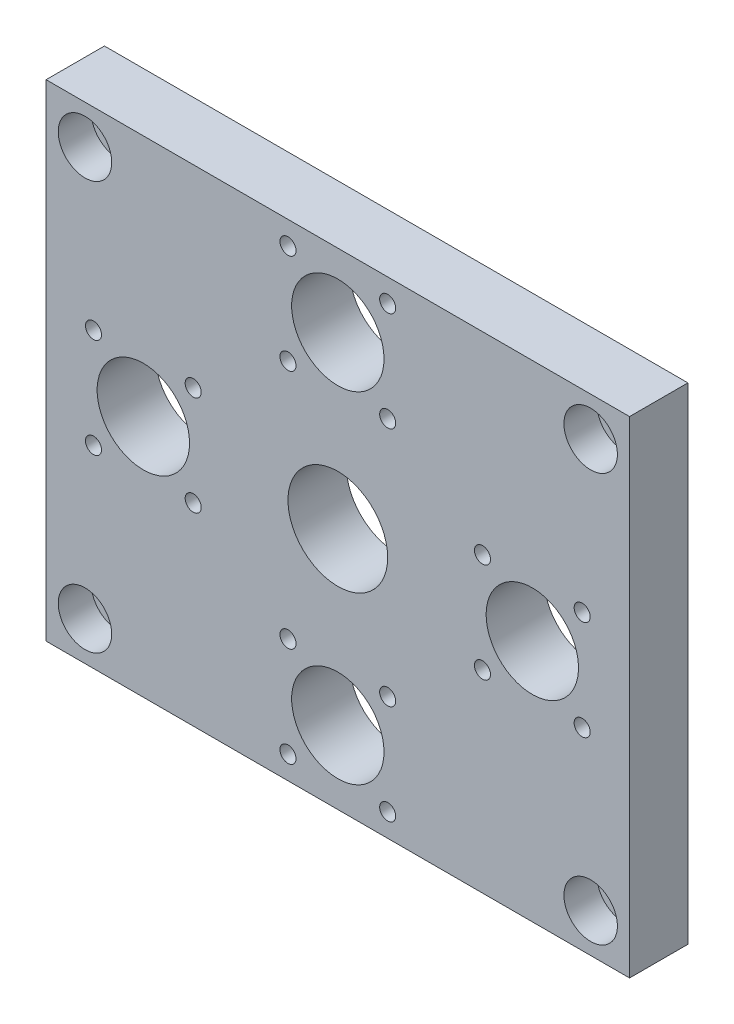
ISO-10303-21;
HEADER;
FILE_DESCRIPTION(('STEP AP214'),'2;1');
FILE_NAME('part.step','',(''),(''),'','','');
FILE_SCHEMA(('AUTOMOTIVE_DESIGN { 1 0 10303 214 1 1 1 1 }'));
ENDSEC;
DATA;
#1=APPLICATION_CONTEXT('core data for automotive mechanical design processes');
#2=APPLICATION_PROTOCOL_DEFINITION('international standard','automotive_design',2000,#1);
#3=PRODUCT_CONTEXT('',#1,'mechanical');
#4=PRODUCT('Part','Part','',(#3));
#5=PRODUCT_RELATED_PRODUCT_CATEGORY('part','',(#4));
#6=PRODUCT_DEFINITION_FORMATION('','',#4);
#7=PRODUCT_DEFINITION_CONTEXT('part definition',#1,'design');
#8=PRODUCT_DEFINITION('design','',#6,#7);
#9=PRODUCT_DEFINITION_SHAPE('','',#8);
#10=(LENGTH_UNIT() NAMED_UNIT(*) SI_UNIT(.MILLI.,.METRE.));
#11=(NAMED_UNIT(*) PLANE_ANGLE_UNIT() SI_UNIT($,.RADIAN.));
#12=(NAMED_UNIT(*) SI_UNIT($,.STERADIAN.) SOLID_ANGLE_UNIT());
#13=UNCERTAINTY_MEASURE_WITH_UNIT(LENGTH_MEASURE(1.E-05),#10,'distance_accuracy_value','');
#14=(GEOMETRIC_REPRESENTATION_CONTEXT(3) GLOBAL_UNCERTAINTY_ASSIGNED_CONTEXT((#13)) GLOBAL_UNIT_ASSIGNED_CONTEXT((#10,
#11,#12)) REPRESENTATION_CONTEXT('',''));
#15=CARTESIAN_POINT('',(0.,0.,0.));
#16=DIRECTION('',(0.,0.,1.));
#17=DIRECTION('',(1.,0.,0.));
#18=AXIS2_PLACEMENT_3D('',#15,#16,#17);
#19=CARTESIAN_POINT('',(-343.662294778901,150.72632828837,12.));
#20=DIRECTION('',(0.,0.,1.));
#21=DIRECTION('',(1.,0.,0.));
#22=AXIS2_PLACEMENT_3D('',#19,#20,#21);
#23=CYLINDRICAL_SURFACE('',#22,3.3);
#24=CARTESIAN_POINT('',(-343.662294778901,150.72632828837,5.2));
#25=DIRECTION('',(0.,0.,1.));
#26=DIRECTION('',(1.,0.,0.));
#27=AXIS2_PLACEMENT_3D('',#24,#25,#26);
#28=CIRCLE('',#27,3.3);
#29=CARTESIAN_POINT('',(-340.362294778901,150.72632828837,5.2));
#30=VERTEX_POINT('',#29);
#31=EDGE_CURVE('E131',#30,#30,#28,.T.);
#32=ORIENTED_EDGE('',*,*,#31,.T.);
#33=EDGE_LOOP('',(#32));
#34=FACE_BOUND('',#33,.T.);
#35=CARTESIAN_POINT('',(-343.662294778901,150.72632828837,2.));
#36=DIRECTION('',(0.,0.,-1.));
#37=DIRECTION('',(-1.,0.,0.));
#38=AXIS2_PLACEMENT_3D('',#35,#36,#37);
#39=CIRCLE('',#38,3.3);
#40=CARTESIAN_POINT('',(-346.962294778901,150.72632828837,2.));
#41=VERTEX_POINT('',#40);
#42=EDGE_CURVE('E97',#41,#41,#39,.F.);
#43=ORIENTED_EDGE('',*,*,#42,.F.);
#44=EDGE_LOOP('',(#43));
#45=FACE_BOUND('',#44,.T.);
#46=ADVANCED_FACE('F16',(#34,#45),#23,.F.);
#47=CARTESIAN_POINT('',(-343.662294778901,66.7263282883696,12.));
#48=DIRECTION('',(0.,0.,1.));
#49=DIRECTION('',(1.,0.,0.));
#50=AXIS2_PLACEMENT_3D('',#47,#48,#49);
#51=CYLINDRICAL_SURFACE('',#50,3.3);
#52=CARTESIAN_POINT('',(-343.662294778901,66.7263282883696,5.2));
#53=DIRECTION('',(0.,0.,1.));
#54=DIRECTION('',(1.,0.,0.));
#55=AXIS2_PLACEMENT_3D('',#52,#53,#54);
#56=CIRCLE('',#55,3.3);
#57=CARTESIAN_POINT('',(-340.362294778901,66.7263282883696,5.2));
#58=VERTEX_POINT('',#57);
#59=EDGE_CURVE('E140',#58,#58,#56,.T.);
#60=ORIENTED_EDGE('',*,*,#59,.T.);
#61=EDGE_LOOP('',(#60));
#62=FACE_BOUND('',#61,.T.);
#63=CARTESIAN_POINT('',(-343.662294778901,66.7263282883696,2.));
#64=DIRECTION('',(0.,0.,-1.));
#65=DIRECTION('',(-1.,0.,0.));
#66=AXIS2_PLACEMENT_3D('',#63,#64,#65);
#67=CIRCLE('',#66,3.3);
#68=CARTESIAN_POINT('',(-346.962294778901,66.7263282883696,2.));
#69=VERTEX_POINT('',#68);
#70=EDGE_CURVE('E92',#69,#69,#67,.F.);
#71=ORIENTED_EDGE('',*,*,#70,.F.);
#72=EDGE_LOOP('',(#71));
#73=FACE_BOUND('',#72,.T.);
#74=ADVANCED_FACE('F193',(#62,#73),#51,.F.);
#75=CARTESIAN_POINT('',(-335.662294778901,158.72632828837,12.));
#76=DIRECTION('',(-1.,0.,0.));
#77=DIRECTION('',(0.,0.,1.));
#78=AXIS2_PLACEMENT_3D('',#75,#76,#77);
#79=PLANE('',#78);
#80=DIRECTION('',(0.,1.,0.));
#81=VECTOR('',#80,1.);
#82=CARTESIAN_POINT('',(-335.662294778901,158.72632828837,0.));
#83=LINE('',#82,#81);
#84=CARTESIAN_POINT('',(-335.662294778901,58.7263282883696,0.));
#85=VERTEX_POINT('',#84);
#86=CARTESIAN_POINT('',(-335.662294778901,158.72632828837,0.));
#87=VERTEX_POINT('',#86);
#88=EDGE_CURVE('E83',#85,#87,#83,.T.);
#89=ORIENTED_EDGE('',*,*,#88,.T.);
#90=DIRECTION('',(0.,0.,-1.));
#91=VECTOR('',#90,1.);
#92=CARTESIAN_POINT('',(-335.662294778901,158.72632828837,12.));
#93=LINE('',#92,#91);
#94=CARTESIAN_POINT('',(-335.662294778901,158.72632828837,12.));
#95=VERTEX_POINT('',#94);
#96=EDGE_CURVE('E11',#95,#87,#93,.T.);
#97=ORIENTED_EDGE('',*,*,#96,.F.);
#98=DIRECTION('',(0.,1.,0.));
#99=VECTOR('',#98,1.);
#100=CARTESIAN_POINT('',(-335.662294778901,158.72632828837,12.));
#101=LINE('',#100,#99);
#102=CARTESIAN_POINT('',(-335.662294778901,58.7263282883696,12.));
#103=VERTEX_POINT('',#102);
#104=EDGE_CURVE('E70',#103,#95,#101,.T.);
#105=ORIENTED_EDGE('',*,*,#104,.F.);
#106=DIRECTION('',(0.,0.,-1.));
#107=VECTOR('',#106,1.);
#108=CARTESIAN_POINT('',(-335.662294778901,58.7263282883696,12.));
#109=LINE('',#108,#107);
#110=EDGE_CURVE('E79',#103,#85,#109,.T.);
#111=ORIENTED_EDGE('',*,*,#110,.T.);
#112=EDGE_LOOP('',(#89,#97,#105,#111));
#113=FACE_BOUND('',#112,.T.);
#114=ADVANCED_FACE('F18',(#113),#79,.F.);
#115=CARTESIAN_POINT('',(-455.662294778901,158.72632828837,12.));
#116=DIRECTION('',(0.,-1.,0.));
#117=DIRECTION('',(0.,0.,-1.));
#118=AXIS2_PLACEMENT_3D('',#115,#116,#117);
#119=PLANE('',#118);
#120=DIRECTION('',(-1.,0.,0.));
#121=VECTOR('',#120,1.);
#122=CARTESIAN_POINT('',(-455.662294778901,158.72632828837,0.));
#123=LINE('',#122,#121);
#124=CARTESIAN_POINT('',(-455.662294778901,158.72632828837,0.));
#125=VERTEX_POINT('',#124);
#126=EDGE_CURVE('E74',#87,#125,#123,.T.);
#127=ORIENTED_EDGE('',*,*,#126,.T.);
#128=DIRECTION('',(0.,0.,-1.));
#129=VECTOR('',#128,1.);
#130=CARTESIAN_POINT('',(-455.662294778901,158.72632828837,12.));
#131=LINE('',#130,#129);
#132=CARTESIAN_POINT('',(-455.662294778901,158.72632828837,12.));
#133=VERTEX_POINT('',#132);
#134=EDGE_CURVE('E26',#133,#125,#131,.T.);
#135=ORIENTED_EDGE('',*,*,#134,.F.);
#136=DIRECTION('',(-1.,0.,0.));
#137=VECTOR('',#136,1.);
#138=CARTESIAN_POINT('',(-455.662294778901,158.72632828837,12.));
#139=LINE('',#138,#137);
#140=EDGE_CURVE('E65',#95,#133,#139,.T.);
#141=ORIENTED_EDGE('',*,*,#140,.F.);
#142=ORIENTED_EDGE('',*,*,#96,.T.);
#143=EDGE_LOOP('',(#127,#135,#141,#142));
#144=FACE_BOUND('',#143,.T.);
#145=ADVANCED_FACE('F73',(#144),#119,.F.);
#146=CARTESIAN_POINT('',(-455.662294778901,158.72632828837,12.));
#147=DIRECTION('',(1.,0.,0.));
#148=DIRECTION('',(0.,0.,-1.));
#149=AXIS2_PLACEMENT_3D('',#146,#147,#148);
#150=PLANE('',#149);
#151=DIRECTION('',(0.,-1.,0.));
#152=VECTOR('',#151,1.);
#153=CARTESIAN_POINT('',(-455.662294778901,158.72632828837,0.));
#154=LINE('',#153,#152);
#155=CARTESIAN_POINT('',(-455.662294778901,58.7263282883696,0.));
#156=VERTEX_POINT('',#155);
#157=EDGE_CURVE('E52',#125,#156,#154,.T.);
#158=ORIENTED_EDGE('',*,*,#157,.T.);
#159=DIRECTION('',(0.,0.,-1.));
#160=VECTOR('',#159,1.);
#161=CARTESIAN_POINT('',(-455.662294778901,58.7263282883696,12.));
#162=LINE('',#161,#160);
#163=CARTESIAN_POINT('',(-455.662294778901,58.7263282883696,12.));
#164=VERTEX_POINT('',#163);
#165=EDGE_CURVE('E75',#164,#156,#162,.T.);
#166=ORIENTED_EDGE('',*,*,#165,.F.);
#167=DIRECTION('',(0.,-1.,0.));
#168=VECTOR('',#167,1.);
#169=CARTESIAN_POINT('',(-455.662294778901,158.72632828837,12.));
#170=LINE('',#169,#168);
#171=EDGE_CURVE('E68',#133,#164,#170,.T.);
#172=ORIENTED_EDGE('',*,*,#171,.F.);
#173=ORIENTED_EDGE('',*,*,#134,.T.);
#174=EDGE_LOOP('',(#158,#166,#172,#173));
#175=FACE_BOUND('',#174,.T.);
#176=ADVANCED_FACE('F77',(#175),#150,.F.);
#177=CARTESIAN_POINT('',(-455.662294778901,58.7263282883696,12.));
#178=DIRECTION('',(0.,1.,0.));
#179=DIRECTION('',(0.,0.,1.));
#180=AXIS2_PLACEMENT_3D('',#177,#178,#179);
#181=PLANE('',#180);
#182=DIRECTION('',(1.,0.,0.));
#183=VECTOR('',#182,1.);
#184=CARTESIAN_POINT('',(-455.662294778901,58.7263282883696,0.));
#185=LINE('',#184,#183);
#186=EDGE_CURVE('E58',#156,#85,#185,.T.);
#187=ORIENTED_EDGE('',*,*,#186,.T.);
#188=ORIENTED_EDGE('',*,*,#110,.F.);
#189=DIRECTION('',(1.,0.,0.));
#190=VECTOR('',#189,1.);
#191=CARTESIAN_POINT('',(-455.662294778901,58.7263282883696,12.));
#192=LINE('',#191,#190);
#193=EDGE_CURVE('E35',#164,#103,#192,.T.);
#194=ORIENTED_EDGE('',*,*,#193,.F.);
#195=ORIENTED_EDGE('',*,*,#165,.T.);
#196=EDGE_LOOP('',(#187,#188,#194,#195));
#197=FACE_BOUND('',#196,.T.);
#198=ADVANCED_FACE('F178',(#197),#181,.F.);
#199=CARTESIAN_POINT('',(0.,0.,12.));
#200=DIRECTION('',(0.,0.,1.));
#201=DIRECTION('',(1.,0.,0.));
#202=AXIS2_PLACEMENT_3D('',#199,#200,#201);
#203=PLANE('',#202);
#204=CARTESIAN_POINT('',(-345.409246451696,118.979376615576,12.));
#205=DIRECTION('',(0.,0.,1.));
#206=DIRECTION('',(1.,0.,0.));
#207=AXIS2_PLACEMENT_3D('',#204,#205,#206);
#208=CIRCLE('',#207,1.65);
#209=CARTESIAN_POINT('',(-343.759246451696,118.979376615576,12.));
#210=VERTEX_POINT('',#209);
#211=EDGE_CURVE('E653',#210,#210,#208,.T.);
#212=ORIENTED_EDGE('',*,*,#211,.F.);
#213=EDGE_LOOP('',(#212));
#214=FACE_BOUND('',#213,.T.);
#215=CARTESIAN_POINT('',(-345.409246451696,98.4732799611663,12.));
#216=DIRECTION('',(0.,0.,1.));
#217=DIRECTION('',(1.,0.,0.));
#218=AXIS2_PLACEMENT_3D('',#215,#216,#217);
#219=CIRCLE('',#218,1.65);
#220=CARTESIAN_POINT('',(-343.759246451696,98.4732799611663,12.));
#221=VERTEX_POINT('',#220);
#222=EDGE_CURVE('E655',#221,#221,#219,.T.);
#223=ORIENTED_EDGE('',*,*,#222,.F.);
#224=EDGE_LOOP('',(#223));
#225=FACE_BOUND('',#224,.T.);
#226=CARTESIAN_POINT('',(-365.915343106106,98.4732799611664,12.));
#227=DIRECTION('',(0.,0.,1.));
#228=DIRECTION('',(1.,0.,0.));
#229=AXIS2_PLACEMENT_3D('',#226,#227,#228);
#230=CIRCLE('',#229,1.65);
#231=CARTESIAN_POINT('',(-364.265343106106,98.4732799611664,12.));
#232=VERTEX_POINT('',#231);
#233=EDGE_CURVE('E663',#232,#232,#230,.T.);
#234=ORIENTED_EDGE('',*,*,#233,.F.);
#235=EDGE_LOOP('',(#234));
#236=FACE_BOUND('',#235,.T.);
#237=CARTESIAN_POINT('',(-365.915343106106,118.979376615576,12.));
#238=DIRECTION('',(0.,0.,1.));
#239=DIRECTION('',(1.,0.,0.));
#240=AXIS2_PLACEMENT_3D('',#237,#238,#239);
#241=CIRCLE('',#240,1.65);
#242=CARTESIAN_POINT('',(-364.265343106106,118.979376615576,12.));
#243=VERTEX_POINT('',#242);
#244=EDGE_CURVE('E669',#243,#243,#241,.T.);
#245=ORIENTED_EDGE('',*,*,#244,.F.);
#246=EDGE_LOOP('',(#245));
#247=FACE_BOUND('',#246,.T.);
#248=CARTESIAN_POINT('',(-405.915343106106,83.9793766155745,12.));
#249=DIRECTION('',(0.,0.,1.));
#250=DIRECTION('',(1.,0.,0.));
#251=AXIS2_PLACEMENT_3D('',#248,#249,#250);
#252=CIRCLE('',#251,1.65);
#253=CARTESIAN_POINT('',(-404.265343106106,83.9793766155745,12.));
#254=VERTEX_POINT('',#253);
#255=EDGE_CURVE('E675',#254,#254,#252,.T.);
#256=ORIENTED_EDGE('',*,*,#255,.F.);
#257=EDGE_LOOP('',(#256));
#258=FACE_BOUND('',#257,.T.);
#259=CARTESIAN_POINT('',(-385.409246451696,83.9793766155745,12.));
#260=DIRECTION('',(0.,0.,1.));
#261=DIRECTION('',(1.,0.,0.));
#262=AXIS2_PLACEMENT_3D('',#259,#260,#261);
#263=CIRCLE('',#262,1.65);
#264=CARTESIAN_POINT('',(-383.759246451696,83.9793766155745,12.));
#265=VERTEX_POINT('',#264);
#266=EDGE_CURVE('E681',#265,#265,#263,.T.);
#267=ORIENTED_EDGE('',*,*,#266,.F.);
#268=EDGE_LOOP('',(#267));
#269=FACE_BOUND('',#268,.T.);
#270=CARTESIAN_POINT('',(-385.409246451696,63.4732799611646,12.));
#271=DIRECTION('',(0.,0.,1.));
#272=DIRECTION('',(1.,0.,0.));
#273=AXIS2_PLACEMENT_3D('',#270,#271,#272);
#274=CIRCLE('',#273,1.65);
#275=CARTESIAN_POINT('',(-383.759246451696,63.4732799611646,12.));
#276=VERTEX_POINT('',#275);
#277=EDGE_CURVE('E687',#276,#276,#274,.T.);
#278=ORIENTED_EDGE('',*,*,#277,.F.);
#279=EDGE_LOOP('',(#278));
#280=FACE_BOUND('',#279,.T.);
#281=CARTESIAN_POINT('',(-405.915343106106,63.4732799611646,12.));
#282=DIRECTION('',(0.,0.,1.));
#283=DIRECTION('',(1.,0.,0.));
#284=AXIS2_PLACEMENT_3D('',#281,#282,#283);
#285=CIRCLE('',#284,1.65);
#286=CARTESIAN_POINT('',(-404.265343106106,63.4732799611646,12.));
#287=VERTEX_POINT('',#286);
#288=EDGE_CURVE('E693',#287,#287,#285,.T.);
#289=ORIENTED_EDGE('',*,*,#288,.F.);
#290=EDGE_LOOP('',(#289));
#291=FACE_BOUND('',#290,.T.);
#292=CARTESIAN_POINT('',(-405.915343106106,153.979376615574,12.));
#293=DIRECTION('',(0.,0.,1.));
#294=DIRECTION('',(1.,0.,0.));
#295=AXIS2_PLACEMENT_3D('',#292,#293,#294);
#296=CIRCLE('',#295,1.65);
#297=CARTESIAN_POINT('',(-404.265343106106,153.979376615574,12.));
#298=VERTEX_POINT('',#297);
#299=EDGE_CURVE('E699',#298,#298,#296,.T.);
#300=ORIENTED_EDGE('',*,*,#299,.F.);
#301=EDGE_LOOP('',(#300));
#302=FACE_BOUND('',#301,.T.);
#303=CARTESIAN_POINT('',(-385.409246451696,153.979376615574,12.));
#304=DIRECTION('',(0.,0.,1.));
#305=DIRECTION('',(1.,0.,0.));
#306=AXIS2_PLACEMENT_3D('',#303,#304,#305);
#307=CIRCLE('',#306,1.65);
#308=CARTESIAN_POINT('',(-383.759246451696,153.979376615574,12.));
#309=VERTEX_POINT('',#308);
#310=EDGE_CURVE('E705',#309,#309,#307,.T.);
#311=ORIENTED_EDGE('',*,*,#310,.F.);
#312=EDGE_LOOP('',(#311));
#313=FACE_BOUND('',#312,.T.);
#314=CARTESIAN_POINT('',(-385.409246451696,133.473279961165,12.));
#315=DIRECTION('',(0.,0.,1.));
#316=DIRECTION('',(1.,0.,0.));
#317=AXIS2_PLACEMENT_3D('',#314,#315,#316);
#318=CIRCLE('',#317,1.65);
#319=CARTESIAN_POINT('',(-383.759246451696,133.473279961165,12.));
#320=VERTEX_POINT('',#319);
#321=EDGE_CURVE('E711',#320,#320,#318,.T.);
#322=ORIENTED_EDGE('',*,*,#321,.F.);
#323=EDGE_LOOP('',(#322));
#324=FACE_BOUND('',#323,.T.);
#325=CARTESIAN_POINT('',(-405.915343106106,133.473279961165,12.));
#326=DIRECTION('',(0.,0.,1.));
#327=DIRECTION('',(1.,0.,0.));
#328=AXIS2_PLACEMENT_3D('',#325,#326,#327);
#329=CIRCLE('',#328,1.65);
#330=CARTESIAN_POINT('',(-404.265343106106,133.473279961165,12.));
#331=VERTEX_POINT('',#330);
#332=EDGE_CURVE('E717',#331,#331,#329,.T.);
#333=ORIENTED_EDGE('',*,*,#332,.F.);
#334=EDGE_LOOP('',(#333));
#335=FACE_BOUND('',#334,.T.);
#336=CARTESIAN_POINT('',(-425.409246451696,98.4732799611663,12.));
#337=DIRECTION('',(0.,0.,1.));
#338=DIRECTION('',(1.,0.,0.));
#339=AXIS2_PLACEMENT_3D('',#336,#337,#338);
#340=CIRCLE('',#339,1.65);
#341=CARTESIAN_POINT('',(-423.759246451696,98.4732799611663,12.));
#342=VERTEX_POINT('',#341);
#343=EDGE_CURVE('E723',#342,#342,#340,.T.);
#344=ORIENTED_EDGE('',*,*,#343,.F.);
#345=EDGE_LOOP('',(#344));
#346=FACE_BOUND('',#345,.T.);
#347=CARTESIAN_POINT('',(-425.409246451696,118.979376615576,12.));
#348=DIRECTION('',(0.,0.,1.));
#349=DIRECTION('',(1.,0.,0.));
#350=AXIS2_PLACEMENT_3D('',#347,#348,#349);
#351=CIRCLE('',#350,1.65);
#352=CARTESIAN_POINT('',(-423.759246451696,118.979376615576,12.));
#353=VERTEX_POINT('',#352);
#354=EDGE_CURVE('E729',#353,#353,#351,.T.);
#355=ORIENTED_EDGE('',*,*,#354,.F.);
#356=EDGE_LOOP('',(#355));
#357=FACE_BOUND('',#356,.T.);
#358=CARTESIAN_POINT('',(-445.915343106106,118.979376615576,12.));
#359=DIRECTION('',(0.,0.,1.));
#360=DIRECTION('',(1.,0.,0.));
#361=AXIS2_PLACEMENT_3D('',#358,#359,#360);
#362=CIRCLE('',#361,1.65);
#363=CARTESIAN_POINT('',(-444.265343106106,118.979376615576,12.));
#364=VERTEX_POINT('',#363);
#365=EDGE_CURVE('E735',#364,#364,#362,.T.);
#366=ORIENTED_EDGE('',*,*,#365,.F.);
#367=EDGE_LOOP('',(#366));
#368=FACE_BOUND('',#367,.T.);
#369=CARTESIAN_POINT('',(-445.915343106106,98.4732799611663,12.));
#370=DIRECTION('',(0.,0.,1.));
#371=DIRECTION('',(1.,0.,0.));
#372=AXIS2_PLACEMENT_3D('',#369,#370,#371);
#373=CIRCLE('',#372,1.65);
#374=CARTESIAN_POINT('',(-444.265343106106,98.4732799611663,12.));
#375=VERTEX_POINT('',#374);
#376=EDGE_CURVE('E741',#375,#375,#373,.T.);
#377=ORIENTED_EDGE('',*,*,#376,.F.);
#378=EDGE_LOOP('',(#377));
#379=FACE_BOUND('',#378,.T.);
#380=CARTESIAN_POINT('',(-395.662294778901,73.7263282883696,12.));
#381=DIRECTION('',(0.,0.,1.));
#382=DIRECTION('',(1.,0.,0.));
#383=AXIS2_PLACEMENT_3D('',#380,#381,#382);
#384=CIRCLE('',#383,9.5);
#385=CARTESIAN_POINT('',(-386.162294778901,73.7263282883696,12.));
#386=VERTEX_POINT('',#385);
#387=EDGE_CURVE('E747',#386,#386,#384,.T.);
#388=ORIENTED_EDGE('',*,*,#387,.F.);
#389=EDGE_LOOP('',(#388));
#390=FACE_BOUND('',#389,.T.);
#391=CARTESIAN_POINT('',(-395.662294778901,143.72632828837,12.));
#392=DIRECTION('',(0.,0.,1.));
#393=DIRECTION('',(1.,0.,0.));
#394=AXIS2_PLACEMENT_3D('',#391,#392,#393);
#395=CIRCLE('',#394,9.5);
#396=CARTESIAN_POINT('',(-386.162294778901,143.72632828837,12.));
#397=VERTEX_POINT('',#396);
#398=EDGE_CURVE('E751',#397,#397,#395,.T.);
#399=ORIENTED_EDGE('',*,*,#398,.F.);
#400=EDGE_LOOP('',(#399));
#401=FACE_BOUND('',#400,.T.);
#402=CARTESIAN_POINT('',(-355.662294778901,108.726328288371,12.));
#403=DIRECTION('',(0.,0.,1.));
#404=DIRECTION('',(-1.,0.,0.));
#405=AXIS2_PLACEMENT_3D('',#402,#403,#404);
#406=CIRCLE('',#405,9.5);
#407=CARTESIAN_POINT('',(-365.162294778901,108.726328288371,12.));
#408=VERTEX_POINT('',#407);
#409=EDGE_CURVE('E757',#408,#408,#406,.T.);
#410=ORIENTED_EDGE('',*,*,#409,.F.);
#411=EDGE_LOOP('',(#410));
#412=FACE_BOUND('',#411,.T.);
#413=CARTESIAN_POINT('',(-435.662294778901,108.726328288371,12.));
#414=DIRECTION('',(0.,0.,1.));
#415=DIRECTION('',(1.,0.,0.));
#416=AXIS2_PLACEMENT_3D('',#413,#414,#415);
#417=CIRCLE('',#416,9.5);
#418=CARTESIAN_POINT('',(-426.162294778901,108.726328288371,12.));
#419=VERTEX_POINT('',#418);
#420=EDGE_CURVE('E763',#419,#419,#417,.T.);
#421=ORIENTED_EDGE('',*,*,#420,.F.);
#422=EDGE_LOOP('',(#421));
#423=FACE_BOUND('',#422,.T.);
#424=CARTESIAN_POINT('',(-343.662294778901,150.72632828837,12.));
#425=DIRECTION('',(0.,0.,1.));
#426=DIRECTION('',(1.,0.,0.));
#427=AXIS2_PLACEMENT_3D('',#424,#425,#426);
#428=CIRCLE('',#427,5.5);
#429=CARTESIAN_POINT('',(-338.162294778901,150.72632828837,12.));
#430=VERTEX_POINT('',#429);
#431=EDGE_CURVE('E95',#430,#430,#428,.T.);
#432=ORIENTED_EDGE('',*,*,#431,.F.);
#433=EDGE_LOOP('',(#432));
#434=FACE_BOUND('',#433,.T.);
#435=CARTESIAN_POINT('',(-343.662294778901,66.7263282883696,12.));
#436=DIRECTION('',(0.,0.,1.));
#437=DIRECTION('',(1.,0.,0.));
#438=AXIS2_PLACEMENT_3D('',#435,#436,#437);
#439=CIRCLE('',#438,5.5);
#440=CARTESIAN_POINT('',(-338.162294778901,66.7263282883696,12.));
#441=VERTEX_POINT('',#440);
#442=EDGE_CURVE('E134',#441,#441,#439,.T.);
#443=ORIENTED_EDGE('',*,*,#442,.F.);
#444=EDGE_LOOP('',(#443));
#445=FACE_BOUND('',#444,.T.);
#446=CARTESIAN_POINT('',(-447.662294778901,66.7263282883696,12.));
#447=DIRECTION('',(0.,0.,1.));
#448=DIRECTION('',(1.,0.,0.));
#449=AXIS2_PLACEMENT_3D('',#446,#447,#448);
#450=CIRCLE('',#449,5.5);
#451=CARTESIAN_POINT('',(-442.162294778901,66.7263282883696,12.));
#452=VERTEX_POINT('',#451);
#453=EDGE_CURVE('E143',#452,#452,#450,.T.);
#454=ORIENTED_EDGE('',*,*,#453,.F.);
#455=EDGE_LOOP('',(#454));
#456=FACE_BOUND('',#455,.T.);
#457=CARTESIAN_POINT('',(-447.662294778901,150.72632828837,12.));
#458=DIRECTION('',(0.,0.,1.));
#459=DIRECTION('',(1.,0.,0.));
#460=AXIS2_PLACEMENT_3D('',#457,#458,#459);
#461=CIRCLE('',#460,5.5);
#462=CARTESIAN_POINT('',(-442.162294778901,150.72632828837,12.));
#463=VERTEX_POINT('',#462);
#464=EDGE_CURVE('E152',#463,#463,#461,.T.);
#465=ORIENTED_EDGE('',*,*,#464,.F.);
#466=EDGE_LOOP('',(#465));
#467=FACE_BOUND('',#466,.T.);
#468=CARTESIAN_POINT('',(-395.662294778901,108.72632828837,12.));
#469=DIRECTION('',(0.,0.,1.));
#470=DIRECTION('',(1.,0.,0.));
#471=AXIS2_PLACEMENT_3D('',#468,#469,#470);
#472=CIRCLE('',#471,10.25);
#473=CARTESIAN_POINT('',(-385.412294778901,108.72632828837,12.));
#474=VERTEX_POINT('',#473);
#475=EDGE_CURVE('E161',#474,#474,#472,.T.);
#476=ORIENTED_EDGE('',*,*,#475,.F.);
#477=EDGE_LOOP('',(#476));
#478=FACE_BOUND('',#477,.T.);
#479=ORIENTED_EDGE('',*,*,#104,.T.);
#480=ORIENTED_EDGE('',*,*,#140,.T.);
#481=ORIENTED_EDGE('',*,*,#171,.T.);
#482=ORIENTED_EDGE('',*,*,#193,.T.);
#483=EDGE_LOOP('',(#479,#480,#481,#482));
#484=FACE_BOUND('',#483,.T.);
#485=ADVANCED_FACE('F66',(#214,#225,#236,#247,#258,#269,#280,#291,#302,#313,#324,#335,#346,#357,
#368,#379,#390,#401,#412,#423,#434,#445,#456,#467,#478,#484),#203,.T.);
#486=CARTESIAN_POINT('',(0.,0.,0.));
#487=DIRECTION('',(0.,0.,1.));
#488=DIRECTION('',(1.,0.,0.));
#489=AXIS2_PLACEMENT_3D('',#486,#487,#488);
#490=PLANE('',#489);
#491=CARTESIAN_POINT('',(-345.409246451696,118.979376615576,0.));
#492=DIRECTION('',(0.,0.,1.));
#493=DIRECTION('',(1.,0.,0.));
#494=AXIS2_PLACEMENT_3D('',#491,#492,#493);
#495=CIRCLE('',#494,1.65);
#496=CARTESIAN_POINT('',(-343.759246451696,118.979376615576,0.));
#497=VERTEX_POINT('',#496);
#498=EDGE_CURVE('E651',#497,#497,#495,.T.);
#499=ORIENTED_EDGE('',*,*,#498,.T.);
#500=EDGE_LOOP('',(#499));
#501=FACE_BOUND('',#500,.T.);
#502=CARTESIAN_POINT('',(-345.409246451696,98.4732799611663,0.));
#503=DIRECTION('',(0.,0.,1.));
#504=DIRECTION('',(1.,0.,0.));
#505=AXIS2_PLACEMENT_3D('',#502,#503,#504);
#506=CIRCLE('',#505,1.65);
#507=CARTESIAN_POINT('',(-343.759246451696,98.4732799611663,0.));
#508=VERTEX_POINT('',#507);
#509=EDGE_CURVE('E660',#508,#508,#506,.T.);
#510=ORIENTED_EDGE('',*,*,#509,.T.);
#511=EDGE_LOOP('',(#510));
#512=FACE_BOUND('',#511,.T.);
#513=CARTESIAN_POINT('',(-365.915343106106,98.4732799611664,0.));
#514=DIRECTION('',(0.,0.,1.));
#515=DIRECTION('',(1.,0.,0.));
#516=AXIS2_PLACEMENT_3D('',#513,#514,#515);
#517=CIRCLE('',#516,1.65);
#518=CARTESIAN_POINT('',(-364.265343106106,98.4732799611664,0.));
#519=VERTEX_POINT('',#518);
#520=EDGE_CURVE('E666',#519,#519,#517,.T.);
#521=ORIENTED_EDGE('',*,*,#520,.T.);
#522=EDGE_LOOP('',(#521));
#523=FACE_BOUND('',#522,.T.);
#524=CARTESIAN_POINT('',(-365.915343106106,118.979376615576,0.));
#525=DIRECTION('',(0.,0.,1.));
#526=DIRECTION('',(1.,0.,0.));
#527=AXIS2_PLACEMENT_3D('',#524,#525,#526);
#528=CIRCLE('',#527,1.65);
#529=CARTESIAN_POINT('',(-364.265343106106,118.979376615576,0.));
#530=VERTEX_POINT('',#529);
#531=EDGE_CURVE('E672',#530,#530,#528,.T.);
#532=ORIENTED_EDGE('',*,*,#531,.T.);
#533=EDGE_LOOP('',(#532));
#534=FACE_BOUND('',#533,.T.);
#535=CARTESIAN_POINT('',(-405.915343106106,83.9793766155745,0.));
#536=DIRECTION('',(0.,0.,1.));
#537=DIRECTION('',(1.,0.,0.));
#538=AXIS2_PLACEMENT_3D('',#535,#536,#537);
#539=CIRCLE('',#538,1.65);
#540=CARTESIAN_POINT('',(-404.265343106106,83.9793766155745,0.));
#541=VERTEX_POINT('',#540);
#542=EDGE_CURVE('E678',#541,#541,#539,.T.);
#543=ORIENTED_EDGE('',*,*,#542,.T.);
#544=EDGE_LOOP('',(#543));
#545=FACE_BOUND('',#544,.T.);
#546=CARTESIAN_POINT('',(-385.409246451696,83.9793766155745,0.));
#547=DIRECTION('',(0.,0.,1.));
#548=DIRECTION('',(1.,0.,0.));
#549=AXIS2_PLACEMENT_3D('',#546,#547,#548);
#550=CIRCLE('',#549,1.65);
#551=CARTESIAN_POINT('',(-383.759246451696,83.9793766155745,0.));
#552=VERTEX_POINT('',#551);
#553=EDGE_CURVE('E684',#552,#552,#550,.T.);
#554=ORIENTED_EDGE('',*,*,#553,.T.);
#555=EDGE_LOOP('',(#554));
#556=FACE_BOUND('',#555,.T.);
#557=CARTESIAN_POINT('',(-385.409246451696,63.4732799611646,0.));
#558=DIRECTION('',(0.,0.,1.));
#559=DIRECTION('',(1.,0.,0.));
#560=AXIS2_PLACEMENT_3D('',#557,#558,#559);
#561=CIRCLE('',#560,1.65);
#562=CARTESIAN_POINT('',(-383.759246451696,63.4732799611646,0.));
#563=VERTEX_POINT('',#562);
#564=EDGE_CURVE('E690',#563,#563,#561,.T.);
#565=ORIENTED_EDGE('',*,*,#564,.T.);
#566=EDGE_LOOP('',(#565));
#567=FACE_BOUND('',#566,.T.);
#568=CARTESIAN_POINT('',(-405.915343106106,63.4732799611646,0.));
#569=DIRECTION('',(0.,0.,1.));
#570=DIRECTION('',(1.,0.,0.));
#571=AXIS2_PLACEMENT_3D('',#568,#569,#570);
#572=CIRCLE('',#571,1.65);
#573=CARTESIAN_POINT('',(-404.265343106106,63.4732799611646,0.));
#574=VERTEX_POINT('',#573);
#575=EDGE_CURVE('E696',#574,#574,#572,.T.);
#576=ORIENTED_EDGE('',*,*,#575,.T.);
#577=EDGE_LOOP('',(#576));
#578=FACE_BOUND('',#577,.T.);
#579=CARTESIAN_POINT('',(-405.915343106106,153.979376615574,0.));
#580=DIRECTION('',(0.,0.,1.));
#581=DIRECTION('',(1.,0.,0.));
#582=AXIS2_PLACEMENT_3D('',#579,#580,#581);
#583=CIRCLE('',#582,1.65);
#584=CARTESIAN_POINT('',(-404.265343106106,153.979376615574,0.));
#585=VERTEX_POINT('',#584);
#586=EDGE_CURVE('E702',#585,#585,#583,.T.);
#587=ORIENTED_EDGE('',*,*,#586,.T.);
#588=EDGE_LOOP('',(#587));
#589=FACE_BOUND('',#588,.T.);
#590=CARTESIAN_POINT('',(-385.409246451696,153.979376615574,0.));
#591=DIRECTION('',(0.,0.,1.));
#592=DIRECTION('',(1.,0.,0.));
#593=AXIS2_PLACEMENT_3D('',#590,#591,#592);
#594=CIRCLE('',#593,1.65);
#595=CARTESIAN_POINT('',(-383.759246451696,153.979376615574,0.));
#596=VERTEX_POINT('',#595);
#597=EDGE_CURVE('E708',#596,#596,#594,.T.);
#598=ORIENTED_EDGE('',*,*,#597,.T.);
#599=EDGE_LOOP('',(#598));
#600=FACE_BOUND('',#599,.T.);
#601=CARTESIAN_POINT('',(-385.409246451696,133.473279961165,0.));
#602=DIRECTION('',(0.,0.,1.));
#603=DIRECTION('',(1.,0.,0.));
#604=AXIS2_PLACEMENT_3D('',#601,#602,#603);
#605=CIRCLE('',#604,1.65);
#606=CARTESIAN_POINT('',(-383.759246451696,133.473279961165,0.));
#607=VERTEX_POINT('',#606);
#608=EDGE_CURVE('E714',#607,#607,#605,.T.);
#609=ORIENTED_EDGE('',*,*,#608,.T.);
#610=EDGE_LOOP('',(#609));
#611=FACE_BOUND('',#610,.T.);
#612=CARTESIAN_POINT('',(-405.915343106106,133.473279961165,0.));
#613=DIRECTION('',(0.,0.,1.));
#614=DIRECTION('',(1.,0.,0.));
#615=AXIS2_PLACEMENT_3D('',#612,#613,#614);
#616=CIRCLE('',#615,1.65);
#617=CARTESIAN_POINT('',(-404.265343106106,133.473279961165,0.));
#618=VERTEX_POINT('',#617);
#619=EDGE_CURVE('E720',#618,#618,#616,.T.);
#620=ORIENTED_EDGE('',*,*,#619,.T.);
#621=EDGE_LOOP('',(#620));
#622=FACE_BOUND('',#621,.T.);
#623=CARTESIAN_POINT('',(-425.409246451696,98.4732799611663,0.));
#624=DIRECTION('',(0.,0.,1.));
#625=DIRECTION('',(1.,0.,0.));
#626=AXIS2_PLACEMENT_3D('',#623,#624,#625);
#627=CIRCLE('',#626,1.65);
#628=CARTESIAN_POINT('',(-423.759246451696,98.4732799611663,0.));
#629=VERTEX_POINT('',#628);
#630=EDGE_CURVE('E726',#629,#629,#627,.T.);
#631=ORIENTED_EDGE('',*,*,#630,.T.);
#632=EDGE_LOOP('',(#631));
#633=FACE_BOUND('',#632,.T.);
#634=CARTESIAN_POINT('',(-425.409246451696,118.979376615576,0.));
#635=DIRECTION('',(0.,0.,1.));
#636=DIRECTION('',(1.,0.,0.));
#637=AXIS2_PLACEMENT_3D('',#634,#635,#636);
#638=CIRCLE('',#637,1.65);
#639=CARTESIAN_POINT('',(-423.759246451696,118.979376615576,0.));
#640=VERTEX_POINT('',#639);
#641=EDGE_CURVE('E732',#640,#640,#638,.T.);
#642=ORIENTED_EDGE('',*,*,#641,.T.);
#643=EDGE_LOOP('',(#642));
#644=FACE_BOUND('',#643,.T.);
#645=CARTESIAN_POINT('',(-445.915343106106,118.979376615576,0.));
#646=DIRECTION('',(0.,0.,1.));
#647=DIRECTION('',(1.,0.,0.));
#648=AXIS2_PLACEMENT_3D('',#645,#646,#647);
#649=CIRCLE('',#648,1.65);
#650=CARTESIAN_POINT('',(-444.265343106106,118.979376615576,0.));
#651=VERTEX_POINT('',#650);
#652=EDGE_CURVE('E738',#651,#651,#649,.T.);
#653=ORIENTED_EDGE('',*,*,#652,.T.);
#654=EDGE_LOOP('',(#653));
#655=FACE_BOUND('',#654,.T.);
#656=CARTESIAN_POINT('',(-445.915343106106,98.4732799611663,0.));
#657=DIRECTION('',(0.,0.,1.));
#658=DIRECTION('',(1.,0.,0.));
#659=AXIS2_PLACEMENT_3D('',#656,#657,#658);
#660=CIRCLE('',#659,1.65);
#661=CARTESIAN_POINT('',(-444.265343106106,98.4732799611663,0.));
#662=VERTEX_POINT('',#661);
#663=EDGE_CURVE('E744',#662,#662,#660,.T.);
#664=ORIENTED_EDGE('',*,*,#663,.T.);
#665=EDGE_LOOP('',(#664));
#666=FACE_BOUND('',#665,.T.);
#667=CARTESIAN_POINT('',(-395.662294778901,73.7263282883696,0.));
#668=DIRECTION('',(0.,0.,1.));
#669=DIRECTION('',(1.,0.,0.));
#670=AXIS2_PLACEMENT_3D('',#667,#668,#669);
#671=CIRCLE('',#670,9.5);
#672=CARTESIAN_POINT('',(-386.162294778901,73.7263282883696,0.));
#673=VERTEX_POINT('',#672);
#674=EDGE_CURVE('E748',#673,#673,#671,.T.);
#675=ORIENTED_EDGE('',*,*,#674,.T.);
#676=EDGE_LOOP('',(#675));
#677=FACE_BOUND('',#676,.T.);
#678=CARTESIAN_POINT('',(-395.662294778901,143.72632828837,0.));
#679=DIRECTION('',(0.,0.,1.));
#680=DIRECTION('',(1.,0.,0.));
#681=AXIS2_PLACEMENT_3D('',#678,#679,#680);
#682=CIRCLE('',#681,9.5);
#683=CARTESIAN_POINT('',(-386.162294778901,143.72632828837,0.));
#684=VERTEX_POINT('',#683);
#685=EDGE_CURVE('E754',#684,#684,#682,.T.);
#686=ORIENTED_EDGE('',*,*,#685,.T.);
#687=EDGE_LOOP('',(#686));
#688=FACE_BOUND('',#687,.T.);
#689=CARTESIAN_POINT('',(-355.662294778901,108.726328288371,0.));
#690=DIRECTION('',(0.,0.,1.));
#691=DIRECTION('',(-1.,0.,0.));
#692=AXIS2_PLACEMENT_3D('',#689,#690,#691);
#693=CIRCLE('',#692,9.5);
#694=CARTESIAN_POINT('',(-365.162294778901,108.726328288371,0.));
#695=VERTEX_POINT('',#694);
#696=EDGE_CURVE('E760',#695,#695,#693,.T.);
#697=ORIENTED_EDGE('',*,*,#696,.T.);
#698=EDGE_LOOP('',(#697));
#699=FACE_BOUND('',#698,.T.);
#700=CARTESIAN_POINT('',(-435.662294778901,108.726328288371,0.));
#701=DIRECTION('',(0.,0.,1.));
#702=DIRECTION('',(1.,0.,0.));
#703=AXIS2_PLACEMENT_3D('',#700,#701,#702);
#704=CIRCLE('',#703,9.5);
#705=CARTESIAN_POINT('',(-426.162294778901,108.726328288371,0.));
#706=VERTEX_POINT('',#705);
#707=EDGE_CURVE('E766',#706,#706,#704,.T.);
#708=ORIENTED_EDGE('',*,*,#707,.T.);
#709=EDGE_LOOP('',(#708));
#710=FACE_BOUND('',#709,.T.);
#711=CARTESIAN_POINT('',(-447.662294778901,66.7263282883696,0.));
#712=DIRECTION('',(0.,0.,-1.));
#713=DIRECTION('',(1.,0.,0.));
#714=AXIS2_PLACEMENT_3D('',#711,#712,#713);
#715=CIRCLE('',#714,5.);
#716=CARTESIAN_POINT('',(-442.662294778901,66.7263282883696,0.));
#717=VERTEX_POINT('',#716);
#718=EDGE_CURVE('E117',#717,#717,#715,.T.);
#719=ORIENTED_EDGE('',*,*,#718,.F.);
#720=EDGE_LOOP('',(#719));
#721=FACE_BOUND('',#720,.T.);
#722=CARTESIAN_POINT('',(-447.662294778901,150.72632828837,0.));
#723=DIRECTION('',(0.,0.,-1.));
#724=DIRECTION('',(1.,0.,0.));
#725=AXIS2_PLACEMENT_3D('',#722,#723,#724);
#726=CIRCLE('',#725,5.);
#727=CARTESIAN_POINT('',(-442.662294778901,150.72632828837,0.));
#728=VERTEX_POINT('',#727);
#729=EDGE_CURVE('E110',#728,#728,#726,.T.);
#730=ORIENTED_EDGE('',*,*,#729,.F.);
#731=EDGE_LOOP('',(#730));
#732=FACE_BOUND('',#731,.T.);
#733=CARTESIAN_POINT('',(-343.662294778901,150.72632828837,0.));
#734=DIRECTION('',(0.,0.,-1.));
#735=DIRECTION('',(-1.,0.,0.));
#736=AXIS2_PLACEMENT_3D('',#733,#734,#735);
#737=CIRCLE('',#736,5.);
#738=CARTESIAN_POINT('',(-348.662294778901,150.72632828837,0.));
#739=VERTEX_POINT('',#738);
#740=EDGE_CURVE('E103',#739,#739,#737,.T.);
#741=ORIENTED_EDGE('',*,*,#740,.F.);
#742=EDGE_LOOP('',(#741));
#743=FACE_BOUND('',#742,.T.);
#744=CARTESIAN_POINT('',(-343.662294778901,66.7263282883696,0.));
#745=DIRECTION('',(0.,0.,-1.));
#746=DIRECTION('',(-1.,0.,0.));
#747=AXIS2_PLACEMENT_3D('',#744,#745,#746);
#748=CIRCLE('',#747,5.);
#749=CARTESIAN_POINT('',(-348.662294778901,66.7263282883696,0.));
#750=VERTEX_POINT('',#749);
#751=EDGE_CURVE('E99',#750,#750,#748,.T.);
#752=ORIENTED_EDGE('',*,*,#751,.F.);
#753=EDGE_LOOP('',(#752));
#754=FACE_BOUND('',#753,.T.);
#755=CARTESIAN_POINT('',(-395.662294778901,108.72632828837,0.));
#756=DIRECTION('',(0.,0.,1.));
#757=DIRECTION('',(1.,0.,0.));
#758=AXIS2_PLACEMENT_3D('',#755,#756,#757);
#759=CIRCLE('',#758,10.25);
#760=CARTESIAN_POINT('',(-385.412294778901,108.72632828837,0.));
#761=VERTEX_POINT('',#760);
#762=EDGE_CURVE('E86',#761,#761,#759,.T.);
#763=ORIENTED_EDGE('',*,*,#762,.T.);
#764=EDGE_LOOP('',(#763));
#765=FACE_BOUND('',#764,.T.);
#766=ORIENTED_EDGE('',*,*,#88,.F.);
#767=ORIENTED_EDGE('',*,*,#186,.F.);
#768=ORIENTED_EDGE('',*,*,#157,.F.);
#769=ORIENTED_EDGE('',*,*,#126,.F.);
#770=EDGE_LOOP('',(#766,#767,#768,#769));
#771=FACE_BOUND('',#770,.T.);
#772=ADVANCED_FACE('F167',(#501,#512,#523,#534,#545,#556,#567,#578,#589,#600,#611,#622,#633,
#644,#655,#666,#677,#688,#699,#710,#721,#732,#743,#754,#765,#771),#490,.F.);
#773=CARTESIAN_POINT('',(-395.662294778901,108.72632828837,12.));
#774=DIRECTION('',(0.,0.,1.));
#775=DIRECTION('',(1.,0.,0.));
#776=AXIS2_PLACEMENT_3D('',#773,#774,#775);
#777=CYLINDRICAL_SURFACE('',#776,10.25);
#778=ORIENTED_EDGE('',*,*,#762,.F.);
#779=EDGE_LOOP('',(#778));
#780=FACE_BOUND('',#779,.T.);
#781=ORIENTED_EDGE('',*,*,#475,.T.);
#782=EDGE_LOOP('',(#781));
#783=FACE_BOUND('',#782,.T.);
#784=ADVANCED_FACE('F170',(#780,#783),#777,.F.);
#785=CARTESIAN_POINT('',(-447.662294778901,150.72632828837,12.));
#786=DIRECTION('',(0.,0.,1.));
#787=DIRECTION('',(1.,0.,0.));
#788=AXIS2_PLACEMENT_3D('',#785,#786,#787);
#789=CYLINDRICAL_SURFACE('',#788,3.3);
#790=CARTESIAN_POINT('',(-447.662294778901,150.72632828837,2.));
#791=DIRECTION('',(0.,0.,1.));
#792=DIRECTION('',(1.,0.,0.));
#793=AXIS2_PLACEMENT_3D('',#790,#791,#792);
#794=CIRCLE('',#793,3.3);
#795=CARTESIAN_POINT('',(-444.362294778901,150.72632828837,2.));
#796=VERTEX_POINT('',#795);
#797=EDGE_CURVE('E101',#796,#796,#794,.F.);
#798=ORIENTED_EDGE('',*,*,#797,.T.);
#799=EDGE_LOOP('',(#798));
#800=FACE_BOUND('',#799,.T.);
#801=CARTESIAN_POINT('',(-447.662294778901,150.72632828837,5.2));
#802=DIRECTION('',(0.,0.,1.));
#803=DIRECTION('',(1.,0.,0.));
#804=AXIS2_PLACEMENT_3D('',#801,#802,#803);
#805=CIRCLE('',#804,3.3);
#806=CARTESIAN_POINT('',(-444.362294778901,150.72632828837,5.2));
#807=VERTEX_POINT('',#806);
#808=EDGE_CURVE('E158',#807,#807,#805,.T.);
#809=ORIENTED_EDGE('',*,*,#808,.T.);
#810=EDGE_LOOP('',(#809));
#811=FACE_BOUND('',#810,.T.);
#812=ADVANCED_FACE('F173',(#800,#811),#789,.F.);
#813=CARTESIAN_POINT('',(-444.3622947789,150.72632828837,5.2));
#814=DIRECTION('',(0.,0.,-1.));
#815=DIRECTION('',(-1.,0.,0.));
#816=AXIS2_PLACEMENT_3D('',#813,#814,#815);
#817=PLANE('',#816);
#818=ORIENTED_EDGE('',*,*,#808,.F.);
#819=EDGE_LOOP('',(#818));
#820=FACE_BOUND('',#819,.T.);
#821=CARTESIAN_POINT('',(-447.662294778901,150.72632828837,5.2));
#822=DIRECTION('',(0.,0.,1.));
#823=DIRECTION('',(1.,0.,0.));
#824=AXIS2_PLACEMENT_3D('',#821,#822,#823);
#825=CIRCLE('',#824,5.5);
#826=CARTESIAN_POINT('',(-442.162294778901,150.72632828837,5.2));
#827=VERTEX_POINT('',#826);
#828=EDGE_CURVE('E155',#827,#827,#825,.T.);
#829=ORIENTED_EDGE('',*,*,#828,.T.);
#830=EDGE_LOOP('',(#829));
#831=FACE_BOUND('',#830,.T.);
#832=ADVANCED_FACE('F230',(#820,#831),#817,.F.);
#833=CARTESIAN_POINT('',(-447.662294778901,150.72632828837,12.));
#834=DIRECTION('',(0.,0.,1.));
#835=DIRECTION('',(1.,0.,0.));
#836=AXIS2_PLACEMENT_3D('',#833,#834,#835);
#837=CYLINDRICAL_SURFACE('',#836,5.5);
#838=ORIENTED_EDGE('',*,*,#828,.F.);
#839=EDGE_LOOP('',(#838));
#840=FACE_BOUND('',#839,.T.);
#841=ORIENTED_EDGE('',*,*,#464,.T.);
#842=EDGE_LOOP('',(#841));
#843=FACE_BOUND('',#842,.T.);
#844=ADVANCED_FACE('F226',(#840,#843),#837,.F.);
#845=CARTESIAN_POINT('',(-447.662294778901,66.7263282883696,12.));
#846=DIRECTION('',(0.,0.,1.));
#847=DIRECTION('',(1.,0.,0.));
#848=AXIS2_PLACEMENT_3D('',#845,#846,#847);
#849=CYLINDRICAL_SURFACE('',#848,3.3);
#850=CARTESIAN_POINT('',(-447.662294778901,66.7263282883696,2.));
#851=DIRECTION('',(0.,0.,1.));
#852=DIRECTION('',(1.,0.,0.));
#853=AXIS2_PLACEMENT_3D('',#850,#851,#852);
#854=CIRCLE('',#853,3.3);
#855=CARTESIAN_POINT('',(-444.362294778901,66.7263282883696,2.));
#856=VERTEX_POINT('',#855);
#857=EDGE_CURVE('E20',#856,#856,#854,.F.);
#858=ORIENTED_EDGE('',*,*,#857,.T.);
#859=EDGE_LOOP('',(#858));
#860=FACE_BOUND('',#859,.T.);
#861=CARTESIAN_POINT('',(-447.662294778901,66.7263282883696,5.2));
#862=DIRECTION('',(0.,0.,1.));
#863=DIRECTION('',(1.,0.,0.));
#864=AXIS2_PLACEMENT_3D('',#861,#862,#863);
#865=CIRCLE('',#864,3.3);
#866=CARTESIAN_POINT('',(-444.362294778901,66.7263282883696,5.2));
#867=VERTEX_POINT('',#866);
#868=EDGE_CURVE('E149',#867,#867,#865,.T.);
#869=ORIENTED_EDGE('',*,*,#868,.T.);
#870=EDGE_LOOP('',(#869));
#871=FACE_BOUND('',#870,.T.);
#872=ADVANCED_FACE('F222',(#860,#871),#849,.F.);
#873=CARTESIAN_POINT('',(-444.3622947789,66.7263282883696,5.2));
#874=DIRECTION('',(0.,0.,-1.));
#875=DIRECTION('',(-1.,0.,0.));
#876=AXIS2_PLACEMENT_3D('',#873,#874,#875);
#877=PLANE('',#876);
#878=ORIENTED_EDGE('',*,*,#868,.F.);
#879=EDGE_LOOP('',(#878));
#880=FACE_BOUND('',#879,.T.);
#881=CARTESIAN_POINT('',(-447.662294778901,66.7263282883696,5.2));
#882=DIRECTION('',(0.,0.,1.));
#883=DIRECTION('',(1.,0.,0.));
#884=AXIS2_PLACEMENT_3D('',#881,#882,#883);
#885=CIRCLE('',#884,5.5);
#886=CARTESIAN_POINT('',(-442.162294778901,66.7263282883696,5.2));
#887=VERTEX_POINT('',#886);
#888=EDGE_CURVE('E146',#887,#887,#885,.T.);
#889=ORIENTED_EDGE('',*,*,#888,.T.);
#890=EDGE_LOOP('',(#889));
#891=FACE_BOUND('',#890,.T.);
#892=ADVANCED_FACE('F218',(#880,#891),#877,.F.);
#893=CARTESIAN_POINT('',(-447.662294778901,66.7263282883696,12.));
#894=DIRECTION('',(0.,0.,1.));
#895=DIRECTION('',(1.,0.,0.));
#896=AXIS2_PLACEMENT_3D('',#893,#894,#895);
#897=CYLINDRICAL_SURFACE('',#896,5.5);
#898=ORIENTED_EDGE('',*,*,#888,.F.);
#899=EDGE_LOOP('',(#898));
#900=FACE_BOUND('',#899,.T.);
#901=ORIENTED_EDGE('',*,*,#453,.T.);
#902=EDGE_LOOP('',(#901));
#903=FACE_BOUND('',#902,.T.);
#904=ADVANCED_FACE('F213',(#900,#903),#897,.F.);
#905=CARTESIAN_POINT('',(-340.362294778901,66.7263282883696,5.2));
#906=DIRECTION('',(0.,0.,-1.));
#907=DIRECTION('',(-1.,0.,0.));
#908=AXIS2_PLACEMENT_3D('',#905,#906,#907);
#909=PLANE('',#908);
#910=ORIENTED_EDGE('',*,*,#59,.F.);
#911=EDGE_LOOP('',(#910));
#912=FACE_BOUND('',#911,.T.);
#913=CARTESIAN_POINT('',(-343.662294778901,66.7263282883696,5.2));
#914=DIRECTION('',(0.,0.,1.));
#915=DIRECTION('',(1.,0.,0.));
#916=AXIS2_PLACEMENT_3D('',#913,#914,#915);
#917=CIRCLE('',#916,5.5);
#918=CARTESIAN_POINT('',(-338.162294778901,66.7263282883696,5.2));
#919=VERTEX_POINT('',#918);
#920=EDGE_CURVE('E137',#919,#919,#917,.T.);
#921=ORIENTED_EDGE('',*,*,#920,.T.);
#922=EDGE_LOOP('',(#921));
#923=FACE_BOUND('',#922,.T.);
#924=ADVANCED_FACE('F210',(#912,#923),#909,.F.);
#925=CARTESIAN_POINT('',(-343.662294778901,66.7263282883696,12.));
#926=DIRECTION('',(0.,0.,1.));
#927=DIRECTION('',(1.,0.,0.));
#928=AXIS2_PLACEMENT_3D('',#925,#926,#927);
#929=CYLINDRICAL_SURFACE('',#928,5.5);
#930=ORIENTED_EDGE('',*,*,#920,.F.);
#931=EDGE_LOOP('',(#930));
#932=FACE_BOUND('',#931,.T.);
#933=ORIENTED_EDGE('',*,*,#442,.T.);
#934=EDGE_LOOP('',(#933));
#935=FACE_BOUND('',#934,.T.);
#936=ADVANCED_FACE('F207',(#932,#935),#929,.F.);
#937=CARTESIAN_POINT('',(-340.362294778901,150.72632828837,5.2));
#938=DIRECTION('',(0.,0.,-1.));
#939=DIRECTION('',(-1.,0.,0.));
#940=AXIS2_PLACEMENT_3D('',#937,#938,#939);
#941=PLANE('',#940);
#942=ORIENTED_EDGE('',*,*,#31,.F.);
#943=EDGE_LOOP('',(#942));
#944=FACE_BOUND('',#943,.T.);
#945=CARTESIAN_POINT('',(-343.662294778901,150.72632828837,5.2));
#946=DIRECTION('',(0.,0.,1.));
#947=DIRECTION('',(1.,0.,0.));
#948=AXIS2_PLACEMENT_3D('',#945,#946,#947);
#949=CIRCLE('',#948,5.5);
#950=CARTESIAN_POINT('',(-338.162294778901,150.72632828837,5.2));
#951=VERTEX_POINT('',#950);
#952=EDGE_CURVE('E128',#951,#951,#949,.T.);
#953=ORIENTED_EDGE('',*,*,#952,.T.);
#954=EDGE_LOOP('',(#953));
#955=FACE_BOUND('',#954,.T.);
#956=ADVANCED_FACE('F205',(#944,#955),#941,.F.);
#957=CARTESIAN_POINT('',(-343.662294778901,150.72632828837,12.));
#958=DIRECTION('',(0.,0.,1.));
#959=DIRECTION('',(1.,0.,0.));
#960=AXIS2_PLACEMENT_3D('',#957,#958,#959);
#961=CYLINDRICAL_SURFACE('',#960,5.5);
#962=ORIENTED_EDGE('',*,*,#952,.F.);
#963=EDGE_LOOP('',(#962));
#964=FACE_BOUND('',#963,.T.);
#965=ORIENTED_EDGE('',*,*,#431,.T.);
#966=EDGE_LOOP('',(#965));
#967=FACE_BOUND('',#966,.T.);
#968=ADVANCED_FACE('F294',(#964,#967),#961,.F.);
#969=CARTESIAN_POINT('',(-343.662294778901,66.7263282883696,2.));
#970=DIRECTION('',(0.,0.,-1.));
#971=DIRECTION('',(-1.,0.,0.));
#972=AXIS2_PLACEMENT_3D('',#969,#970,#971);
#973=PLANE('',#972);
#974=CARTESIAN_POINT('',(-343.662294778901,66.7263282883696,2.));
#975=DIRECTION('',(0.,0.,-1.));
#976=DIRECTION('',(-1.,0.,0.));
#977=AXIS2_PLACEMENT_3D('',#974,#975,#976);
#978=CIRCLE('',#977,5.);
#979=CARTESIAN_POINT('',(-348.662294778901,66.7263282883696,2.));
#980=VERTEX_POINT('',#979);
#981=EDGE_CURVE('E96',#980,#980,#978,.T.);
#982=ORIENTED_EDGE('',*,*,#981,.T.);
#983=EDGE_LOOP('',(#982));
#984=FACE_BOUND('',#983,.T.);
#985=ORIENTED_EDGE('',*,*,#70,.T.);
#986=EDGE_LOOP('',(#985));
#987=FACE_BOUND('',#986,.T.);
#988=ADVANCED_FACE('F302',(#984,#987),#973,.T.);
#989=CARTESIAN_POINT('',(-343.662294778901,66.7263282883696,2.));
#990=DIRECTION('',(0.,0.,-1.));
#991=DIRECTION('',(-1.,0.,0.));
#992=AXIS2_PLACEMENT_3D('',#989,#990,#991);
#993=CYLINDRICAL_SURFACE('',#992,5.);
#994=ORIENTED_EDGE('',*,*,#981,.F.);
#995=EDGE_LOOP('',(#994));
#996=FACE_BOUND('',#995,.T.);
#997=ORIENTED_EDGE('',*,*,#751,.T.);
#998=EDGE_LOOP('',(#997));
#999=FACE_BOUND('',#998,.T.);
#1000=ADVANCED_FACE('F310',(#996,#999),#993,.F.);
#1001=CARTESIAN_POINT('',(-343.662294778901,150.72632828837,2.));
#1002=DIRECTION('',(0.,0.,-1.));
#1003=DIRECTION('',(-1.,0.,0.));
#1004=AXIS2_PLACEMENT_3D('',#1001,#1002,#1003);
#1005=PLANE('',#1004);
#1006=CARTESIAN_POINT('',(-343.662294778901,150.72632828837,2.));
#1007=DIRECTION('',(0.,0.,-1.));
#1008=DIRECTION('',(-1.,0.,0.));
#1009=AXIS2_PLACEMENT_3D('',#1006,#1007,#1008);
#1010=CIRCLE('',#1009,5.);
#1011=CARTESIAN_POINT('',(-348.662294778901,150.72632828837,2.));
#1012=VERTEX_POINT('',#1011);
#1013=EDGE_CURVE('E100',#1012,#1012,#1010,.T.);
#1014=ORIENTED_EDGE('',*,*,#1013,.T.);
#1015=EDGE_LOOP('',(#1014));
#1016=FACE_BOUND('',#1015,.T.);
#1017=ORIENTED_EDGE('',*,*,#42,.T.);
#1018=EDGE_LOOP('',(#1017));
#1019=FACE_BOUND('',#1018,.T.);
#1020=ADVANCED_FACE('F319',(#1016,#1019),#1005,.T.);
#1021=CARTESIAN_POINT('',(-343.662294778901,150.72632828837,2.));
#1022=DIRECTION('',(0.,0.,-1.));
#1023=DIRECTION('',(-1.,0.,0.));
#1024=AXIS2_PLACEMENT_3D('',#1021,#1022,#1023);
#1025=CYLINDRICAL_SURFACE('',#1024,5.);
#1026=ORIENTED_EDGE('',*,*,#1013,.F.);
#1027=EDGE_LOOP('',(#1026));
#1028=FACE_BOUND('',#1027,.T.);
#1029=ORIENTED_EDGE('',*,*,#740,.T.);
#1030=EDGE_LOOP('',(#1029));
#1031=FACE_BOUND('',#1030,.T.);
#1032=ADVANCED_FACE('F328',(#1028,#1031),#1025,.F.);
#1033=CARTESIAN_POINT('',(-447.662294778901,150.72632828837,2.));
#1034=DIRECTION('',(0.,0.,1.));
#1035=DIRECTION('',(1.,0.,0.));
#1036=AXIS2_PLACEMENT_3D('',#1033,#1034,#1035);
#1037=PLANE('',#1036);
#1038=CARTESIAN_POINT('',(-447.662294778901,150.72632828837,2.));
#1039=DIRECTION('',(0.,0.,-1.));
#1040=DIRECTION('',(1.,0.,0.));
#1041=AXIS2_PLACEMENT_3D('',#1038,#1039,#1040);
#1042=CIRCLE('',#1041,5.);
#1043=CARTESIAN_POINT('',(-442.662294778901,150.72632828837,2.));
#1044=VERTEX_POINT('',#1043);
#1045=EDGE_CURVE('E104',#1044,#1044,#1042,.T.);
#1046=ORIENTED_EDGE('',*,*,#1045,.T.);
#1047=EDGE_LOOP('',(#1046));
#1048=FACE_BOUND('',#1047,.T.);
#1049=ORIENTED_EDGE('',*,*,#797,.F.);
#1050=EDGE_LOOP('',(#1049));
#1051=FACE_BOUND('',#1050,.T.);
#1052=ADVANCED_FACE('F337',(#1048,#1051),#1037,.F.);
#1053=CARTESIAN_POINT('',(-447.662294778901,150.72632828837,2.));
#1054=DIRECTION('',(0.,0.,-1.));
#1055=DIRECTION('',(-1.,0.,0.));
#1056=AXIS2_PLACEMENT_3D('',#1053,#1054,#1055);
#1057=CYLINDRICAL_SURFACE('',#1056,5.);
#1058=ORIENTED_EDGE('',*,*,#1045,.F.);
#1059=EDGE_LOOP('',(#1058));
#1060=FACE_BOUND('',#1059,.T.);
#1061=ORIENTED_EDGE('',*,*,#729,.T.);
#1062=EDGE_LOOP('',(#1061));
#1063=FACE_BOUND('',#1062,.T.);
#1064=ADVANCED_FACE('F346',(#1060,#1063),#1057,.F.);
#1065=CARTESIAN_POINT('',(-447.662294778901,66.7263282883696,2.));
#1066=DIRECTION('',(0.,0.,1.));
#1067=DIRECTION('',(1.,0.,0.));
#1068=AXIS2_PLACEMENT_3D('',#1065,#1066,#1067);
#1069=PLANE('',#1068);
#1070=CARTESIAN_POINT('',(-447.662294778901,66.7263282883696,2.));
#1071=DIRECTION('',(0.,0.,-1.));
#1072=DIRECTION('',(1.,0.,0.));
#1073=AXIS2_PLACEMENT_3D('',#1070,#1071,#1072);
#1074=CIRCLE('',#1073,5.);
#1075=CARTESIAN_POINT('',(-442.662294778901,66.7263282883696,2.));
#1076=VERTEX_POINT('',#1075);
#1077=EDGE_CURVE('E770',#1076,#1076,#1074,.T.);
#1078=ORIENTED_EDGE('',*,*,#1077,.T.);
#1079=EDGE_LOOP('',(#1078));
#1080=FACE_BOUND('',#1079,.T.);
#1081=ORIENTED_EDGE('',*,*,#857,.F.);
#1082=EDGE_LOOP('',(#1081));
#1083=FACE_BOUND('',#1082,.T.);
#1084=ADVANCED_FACE('F354',(#1080,#1083),#1069,.F.);
#1085=CARTESIAN_POINT('',(-447.662294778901,66.7263282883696,2.));
#1086=DIRECTION('',(0.,0.,-1.));
#1087=DIRECTION('',(-1.,0.,0.));
#1088=AXIS2_PLACEMENT_3D('',#1085,#1086,#1087);
#1089=CYLINDRICAL_SURFACE('',#1088,5.);
#1090=ORIENTED_EDGE('',*,*,#1077,.F.);
#1091=EDGE_LOOP('',(#1090));
#1092=FACE_BOUND('',#1091,.T.);
#1093=ORIENTED_EDGE('',*,*,#718,.T.);
#1094=EDGE_LOOP('',(#1093));
#1095=FACE_BOUND('',#1094,.T.);
#1096=ADVANCED_FACE('F363',(#1092,#1095),#1089,.F.);
#1097=CARTESIAN_POINT('',(-435.662294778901,108.726328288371,0.));
#1098=DIRECTION('',(0.,0.,1.));
#1099=DIRECTION('',(1.,0.,0.));
#1100=AXIS2_PLACEMENT_3D('',#1097,#1098,#1099);
#1101=CYLINDRICAL_SURFACE('',#1100,9.5);
#1102=ORIENTED_EDGE('',*,*,#707,.F.);
#1103=EDGE_LOOP('',(#1102));
#1104=FACE_BOUND('',#1103,.T.);
#1105=ORIENTED_EDGE('',*,*,#420,.T.);
#1106=EDGE_LOOP('',(#1105));
#1107=FACE_BOUND('',#1106,.T.);
#1108=ADVANCED_FACE('F372',(#1104,#1107),#1101,.F.);
#1109=CARTESIAN_POINT('',(-355.662294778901,108.726328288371,0.));
#1110=DIRECTION('',(0.,0.,1.));
#1111=DIRECTION('',(1.,0.,0.));
#1112=AXIS2_PLACEMENT_3D('',#1109,#1110,#1111);
#1113=CYLINDRICAL_SURFACE('',#1112,9.5);
#1114=ORIENTED_EDGE('',*,*,#696,.F.);
#1115=EDGE_LOOP('',(#1114));
#1116=FACE_BOUND('',#1115,.T.);
#1117=ORIENTED_EDGE('',*,*,#409,.T.);
#1118=EDGE_LOOP('',(#1117));
#1119=FACE_BOUND('',#1118,.T.);
#1120=ADVANCED_FACE('F381',(#1116,#1119),#1113,.F.);
#1121=CARTESIAN_POINT('',(-395.662294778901,143.72632828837,0.));
#1122=DIRECTION('',(0.,0.,1.));
#1123=DIRECTION('',(1.,0.,0.));
#1124=AXIS2_PLACEMENT_3D('',#1121,#1122,#1123);
#1125=CYLINDRICAL_SURFACE('',#1124,9.5);
#1126=ORIENTED_EDGE('',*,*,#685,.F.);
#1127=EDGE_LOOP('',(#1126));
#1128=FACE_BOUND('',#1127,.T.);
#1129=ORIENTED_EDGE('',*,*,#398,.T.);
#1130=EDGE_LOOP('',(#1129));
#1131=FACE_BOUND('',#1130,.T.);
#1132=ADVANCED_FACE('F390',(#1128,#1131),#1125,.F.);
#1133=CARTESIAN_POINT('',(-395.662294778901,73.7263282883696,0.));
#1134=DIRECTION('',(0.,0.,1.));
#1135=DIRECTION('',(1.,0.,0.));
#1136=AXIS2_PLACEMENT_3D('',#1133,#1134,#1135);
#1137=CYLINDRICAL_SURFACE('',#1136,9.5);
#1138=ORIENTED_EDGE('',*,*,#674,.F.);
#1139=EDGE_LOOP('',(#1138));
#1140=FACE_BOUND('',#1139,.T.);
#1141=ORIENTED_EDGE('',*,*,#387,.T.);
#1142=EDGE_LOOP('',(#1141));
#1143=FACE_BOUND('',#1142,.T.);
#1144=ADVANCED_FACE('F399',(#1140,#1143),#1137,.F.);
#1145=CARTESIAN_POINT('',(-445.915343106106,98.4732799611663,12.));
#1146=DIRECTION('',(0.,0.,1.));
#1147=DIRECTION('',(1.,0.,0.));
#1148=AXIS2_PLACEMENT_3D('',#1145,#1146,#1147);
#1149=CYLINDRICAL_SURFACE('',#1148,1.65);
#1150=ORIENTED_EDGE('',*,*,#663,.F.);
#1151=EDGE_LOOP('',(#1150));
#1152=FACE_BOUND('',#1151,.T.);
#1153=ORIENTED_EDGE('',*,*,#376,.T.);
#1154=EDGE_LOOP('',(#1153));
#1155=FACE_BOUND('',#1154,.T.);
#1156=ADVANCED_FACE('F408',(#1152,#1155),#1149,.F.);
#1157=CARTESIAN_POINT('',(-445.915343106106,118.979376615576,12.));
#1158=DIRECTION('',(0.,0.,1.));
#1159=DIRECTION('',(1.,0.,0.));
#1160=AXIS2_PLACEMENT_3D('',#1157,#1158,#1159);
#1161=CYLINDRICAL_SURFACE('',#1160,1.65);
#1162=ORIENTED_EDGE('',*,*,#652,.F.);
#1163=EDGE_LOOP('',(#1162));
#1164=FACE_BOUND('',#1163,.T.);
#1165=ORIENTED_EDGE('',*,*,#365,.T.);
#1166=EDGE_LOOP('',(#1165));
#1167=FACE_BOUND('',#1166,.T.);
#1168=ADVANCED_FACE('F417',(#1164,#1167),#1161,.F.);
#1169=CARTESIAN_POINT('',(-425.409246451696,118.979376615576,12.));
#1170=DIRECTION('',(0.,0.,1.));
#1171=DIRECTION('',(1.,0.,0.));
#1172=AXIS2_PLACEMENT_3D('',#1169,#1170,#1171);
#1173=CYLINDRICAL_SURFACE('',#1172,1.65);
#1174=ORIENTED_EDGE('',*,*,#641,.F.);
#1175=EDGE_LOOP('',(#1174));
#1176=FACE_BOUND('',#1175,.T.);
#1177=ORIENTED_EDGE('',*,*,#354,.T.);
#1178=EDGE_LOOP('',(#1177));
#1179=FACE_BOUND('',#1178,.T.);
#1180=ADVANCED_FACE('F426',(#1176,#1179),#1173,.F.);
#1181=CARTESIAN_POINT('',(-425.409246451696,98.4732799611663,12.));
#1182=DIRECTION('',(0.,0.,1.));
#1183=DIRECTION('',(1.,0.,0.));
#1184=AXIS2_PLACEMENT_3D('',#1181,#1182,#1183);
#1185=CYLINDRICAL_SURFACE('',#1184,1.65);
#1186=ORIENTED_EDGE('',*,*,#630,.F.);
#1187=EDGE_LOOP('',(#1186));
#1188=FACE_BOUND('',#1187,.T.);
#1189=ORIENTED_EDGE('',*,*,#343,.T.);
#1190=EDGE_LOOP('',(#1189));
#1191=FACE_BOUND('',#1190,.T.);
#1192=ADVANCED_FACE('F435',(#1188,#1191),#1185,.F.);
#1193=CARTESIAN_POINT('',(-405.915343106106,133.473279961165,12.));
#1194=DIRECTION('',(0.,0.,1.));
#1195=DIRECTION('',(1.,0.,0.));
#1196=AXIS2_PLACEMENT_3D('',#1193,#1194,#1195);
#1197=CYLINDRICAL_SURFACE('',#1196,1.65);
#1198=ORIENTED_EDGE('',*,*,#619,.F.);
#1199=EDGE_LOOP('',(#1198));
#1200=FACE_BOUND('',#1199,.T.);
#1201=ORIENTED_EDGE('',*,*,#332,.T.);
#1202=EDGE_LOOP('',(#1201));
#1203=FACE_BOUND('',#1202,.T.);
#1204=ADVANCED_FACE('F444',(#1200,#1203),#1197,.F.);
#1205=CARTESIAN_POINT('',(-385.409246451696,133.473279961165,12.));
#1206=DIRECTION('',(0.,0.,1.));
#1207=DIRECTION('',(1.,0.,0.));
#1208=AXIS2_PLACEMENT_3D('',#1205,#1206,#1207);
#1209=CYLINDRICAL_SURFACE('',#1208,1.65);
#1210=ORIENTED_EDGE('',*,*,#608,.F.);
#1211=EDGE_LOOP('',(#1210));
#1212=FACE_BOUND('',#1211,.T.);
#1213=ORIENTED_EDGE('',*,*,#321,.T.);
#1214=EDGE_LOOP('',(#1213));
#1215=FACE_BOUND('',#1214,.T.);
#1216=ADVANCED_FACE('F453',(#1212,#1215),#1209,.F.);
#1217=CARTESIAN_POINT('',(-385.409246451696,153.979376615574,12.));
#1218=DIRECTION('',(0.,0.,1.));
#1219=DIRECTION('',(1.,0.,0.));
#1220=AXIS2_PLACEMENT_3D('',#1217,#1218,#1219);
#1221=CYLINDRICAL_SURFACE('',#1220,1.65);
#1222=ORIENTED_EDGE('',*,*,#597,.F.);
#1223=EDGE_LOOP('',(#1222));
#1224=FACE_BOUND('',#1223,.T.);
#1225=ORIENTED_EDGE('',*,*,#310,.T.);
#1226=EDGE_LOOP('',(#1225));
#1227=FACE_BOUND('',#1226,.T.);
#1228=ADVANCED_FACE('F462',(#1224,#1227),#1221,.F.);
#1229=CARTESIAN_POINT('',(-405.915343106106,153.979376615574,12.));
#1230=DIRECTION('',(0.,0.,1.));
#1231=DIRECTION('',(1.,0.,0.));
#1232=AXIS2_PLACEMENT_3D('',#1229,#1230,#1231);
#1233=CYLINDRICAL_SURFACE('',#1232,1.65);
#1234=ORIENTED_EDGE('',*,*,#586,.F.);
#1235=EDGE_LOOP('',(#1234));
#1236=FACE_BOUND('',#1235,.T.);
#1237=ORIENTED_EDGE('',*,*,#299,.T.);
#1238=EDGE_LOOP('',(#1237));
#1239=FACE_BOUND('',#1238,.T.);
#1240=ADVANCED_FACE('F471',(#1236,#1239),#1233,.F.);
#1241=CARTESIAN_POINT('',(-405.915343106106,63.4732799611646,12.));
#1242=DIRECTION('',(0.,0.,1.));
#1243=DIRECTION('',(1.,0.,0.));
#1244=AXIS2_PLACEMENT_3D('',#1241,#1242,#1243);
#1245=CYLINDRICAL_SURFACE('',#1244,1.65);
#1246=ORIENTED_EDGE('',*,*,#575,.F.);
#1247=EDGE_LOOP('',(#1246));
#1248=FACE_BOUND('',#1247,.T.);
#1249=ORIENTED_EDGE('',*,*,#288,.T.);
#1250=EDGE_LOOP('',(#1249));
#1251=FACE_BOUND('',#1250,.T.);
#1252=ADVANCED_FACE('F480',(#1248,#1251),#1245,.F.);
#1253=CARTESIAN_POINT('',(-385.409246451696,63.4732799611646,12.));
#1254=DIRECTION('',(0.,0.,1.));
#1255=DIRECTION('',(1.,0.,0.));
#1256=AXIS2_PLACEMENT_3D('',#1253,#1254,#1255);
#1257=CYLINDRICAL_SURFACE('',#1256,1.65);
#1258=ORIENTED_EDGE('',*,*,#564,.F.);
#1259=EDGE_LOOP('',(#1258));
#1260=FACE_BOUND('',#1259,.T.);
#1261=ORIENTED_EDGE('',*,*,#277,.T.);
#1262=EDGE_LOOP('',(#1261));
#1263=FACE_BOUND('',#1262,.T.);
#1264=ADVANCED_FACE('F489',(#1260,#1263),#1257,.F.);
#1265=CARTESIAN_POINT('',(-385.409246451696,83.9793766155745,12.));
#1266=DIRECTION('',(0.,0.,1.));
#1267=DIRECTION('',(1.,0.,0.));
#1268=AXIS2_PLACEMENT_3D('',#1265,#1266,#1267);
#1269=CYLINDRICAL_SURFACE('',#1268,1.65);
#1270=ORIENTED_EDGE('',*,*,#553,.F.);
#1271=EDGE_LOOP('',(#1270));
#1272=FACE_BOUND('',#1271,.T.);
#1273=ORIENTED_EDGE('',*,*,#266,.T.);
#1274=EDGE_LOOP('',(#1273));
#1275=FACE_BOUND('',#1274,.T.);
#1276=ADVANCED_FACE('F498',(#1272,#1275),#1269,.F.);
#1277=CARTESIAN_POINT('',(-405.915343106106,83.9793766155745,12.));
#1278=DIRECTION('',(0.,0.,1.));
#1279=DIRECTION('',(1.,0.,0.));
#1280=AXIS2_PLACEMENT_3D('',#1277,#1278,#1279);
#1281=CYLINDRICAL_SURFACE('',#1280,1.65);
#1282=ORIENTED_EDGE('',*,*,#542,.F.);
#1283=EDGE_LOOP('',(#1282));
#1284=FACE_BOUND('',#1283,.T.);
#1285=ORIENTED_EDGE('',*,*,#255,.T.);
#1286=EDGE_LOOP('',(#1285));
#1287=FACE_BOUND('',#1286,.T.);
#1288=ADVANCED_FACE('F507',(#1284,#1287),#1281,.F.);
#1289=CARTESIAN_POINT('',(-365.915343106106,118.979376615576,12.));
#1290=DIRECTION('',(0.,0.,1.));
#1291=DIRECTION('',(1.,0.,0.));
#1292=AXIS2_PLACEMENT_3D('',#1289,#1290,#1291);
#1293=CYLINDRICAL_SURFACE('',#1292,1.65);
#1294=ORIENTED_EDGE('',*,*,#531,.F.);
#1295=EDGE_LOOP('',(#1294));
#1296=FACE_BOUND('',#1295,.T.);
#1297=ORIENTED_EDGE('',*,*,#244,.T.);
#1298=EDGE_LOOP('',(#1297));
#1299=FACE_BOUND('',#1298,.T.);
#1300=ADVANCED_FACE('F516',(#1296,#1299),#1293,.F.);
#1301=CARTESIAN_POINT('',(-365.915343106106,98.4732799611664,12.));
#1302=DIRECTION('',(0.,0.,1.));
#1303=DIRECTION('',(1.,0.,0.));
#1304=AXIS2_PLACEMENT_3D('',#1301,#1302,#1303);
#1305=CYLINDRICAL_SURFACE('',#1304,1.65);
#1306=ORIENTED_EDGE('',*,*,#520,.F.);
#1307=EDGE_LOOP('',(#1306));
#1308=FACE_BOUND('',#1307,.T.);
#1309=ORIENTED_EDGE('',*,*,#233,.T.);
#1310=EDGE_LOOP('',(#1309));
#1311=FACE_BOUND('',#1310,.T.);
#1312=ADVANCED_FACE('F525',(#1308,#1311),#1305,.F.);
#1313=CARTESIAN_POINT('',(-345.409246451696,98.4732799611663,12.));
#1314=DIRECTION('',(0.,0.,1.));
#1315=DIRECTION('',(1.,0.,0.));
#1316=AXIS2_PLACEMENT_3D('',#1313,#1314,#1315);
#1317=CYLINDRICAL_SURFACE('',#1316,1.65);
#1318=ORIENTED_EDGE('',*,*,#509,.F.);
#1319=EDGE_LOOP('',(#1318));
#1320=FACE_BOUND('',#1319,.T.);
#1321=ORIENTED_EDGE('',*,*,#222,.T.);
#1322=EDGE_LOOP('',(#1321));
#1323=FACE_BOUND('',#1322,.T.);
#1324=ADVANCED_FACE('F534',(#1320,#1323),#1317,.F.);
#1325=CARTESIAN_POINT('',(-345.409246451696,118.979376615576,12.));
#1326=DIRECTION('',(0.,0.,1.));
#1327=DIRECTION('',(1.,0.,0.));
#1328=AXIS2_PLACEMENT_3D('',#1325,#1326,#1327);
#1329=CYLINDRICAL_SURFACE('',#1328,1.65);
#1330=ORIENTED_EDGE('',*,*,#498,.F.);
#1331=EDGE_LOOP('',(#1330));
#1332=FACE_BOUND('',#1331,.T.);
#1333=ORIENTED_EDGE('',*,*,#211,.T.);
#1334=EDGE_LOOP('',(#1333));
#1335=FACE_BOUND('',#1334,.T.);
#1336=ADVANCED_FACE('F543',(#1332,#1335),#1329,.F.);
#1337=CLOSED_SHELL('',(#46,#74,#114,#145,#176,#198,#485,#772,#784,#812,#832,#844,#872,#892,#904,
#924,#936,#956,#968,#988,#1000,#1020,#1032,#1052,#1064,#1084,#1096,#1108,#1120,#1132,#1144,
#1156,#1168,#1180,#1192,#1204,#1216,#1228,#1240,#1252,#1264,#1276,#1288,#1300,#1312,#1324,#1336));
#1338=MANIFOLD_SOLID_BREP('B1',#1337);
#1339=ADVANCED_BREP_SHAPE_REPRESENTATION('',(#18,#1338),#14);
#1340=SHAPE_DEFINITION_REPRESENTATION(#9,#1339);
ENDSEC;
END-ISO-10303-21;
